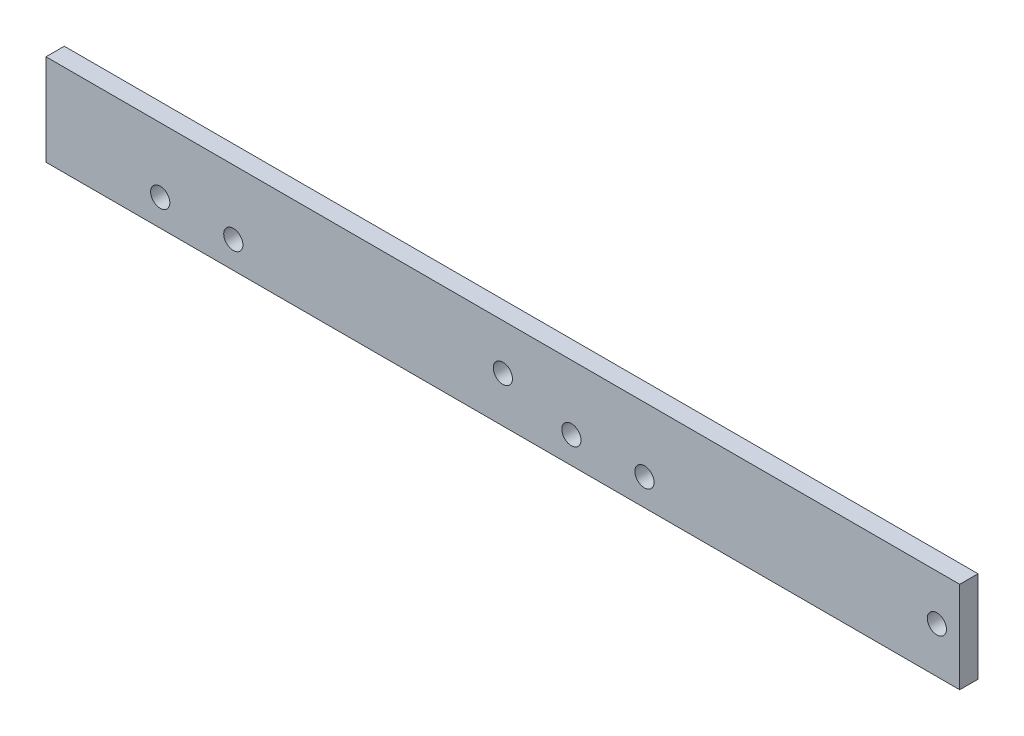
ISO-10303-21;
HEADER;
FILE_DESCRIPTION(('STEP AP214'),'2;1');
FILE_NAME('part.step','',(''),(''),'','','');
FILE_SCHEMA(('AUTOMOTIVE_DESIGN { 1 0 10303 214 1 1 1 1 }'));
ENDSEC;
DATA;
#1=APPLICATION_CONTEXT('core data for automotive mechanical design processes');
#2=APPLICATION_PROTOCOL_DEFINITION('international standard','automotive_design',2000,#1);
#3=PRODUCT_CONTEXT('',#1,'mechanical');
#4=PRODUCT('Part','Part','',(#3));
#5=PRODUCT_RELATED_PRODUCT_CATEGORY('part','',(#4));
#6=PRODUCT_DEFINITION_FORMATION('','',#4);
#7=PRODUCT_DEFINITION_CONTEXT('part definition',#1,'design');
#8=PRODUCT_DEFINITION('design','',#6,#7);
#9=PRODUCT_DEFINITION_SHAPE('','',#8);
#10=(LENGTH_UNIT() NAMED_UNIT(*) SI_UNIT(.MILLI.,.METRE.));
#11=(NAMED_UNIT(*) PLANE_ANGLE_UNIT() SI_UNIT($,.RADIAN.));
#12=(NAMED_UNIT(*) SI_UNIT($,.STERADIAN.) SOLID_ANGLE_UNIT());
#13=UNCERTAINTY_MEASURE_WITH_UNIT(LENGTH_MEASURE(1.E-05),#10,'distance_accuracy_value','');
#14=(GEOMETRIC_REPRESENTATION_CONTEXT(3) GLOBAL_UNCERTAINTY_ASSIGNED_CONTEXT((#13)) GLOBAL_UNIT_ASSIGNED_CONTEXT((#10,
#11,#12)) REPRESENTATION_CONTEXT('',''));
#15=CARTESIAN_POINT('',(0.,0.,0.));
#16=DIRECTION('',(0.,0.,1.));
#17=DIRECTION('',(1.,0.,0.));
#18=AXIS2_PLACEMENT_3D('',#15,#16,#17);
#19=CARTESIAN_POINT('',(0.,0.,4.));
#20=DIRECTION('',(0.,0.,-1.));
#21=DIRECTION('',(-1.,0.,0.));
#22=AXIS2_PLACEMENT_3D('',#19,#20,#21);
#23=PLANE('',#22);
#24=CARTESIAN_POINT('',(15.0000000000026,-4.12920021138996,4.));
#25=DIRECTION('',(0.,0.,1.));
#26=DIRECTION('',(1.,0.,0.));
#27=AXIS2_PLACEMENT_3D('',#24,#25,#26);
#28=CIRCLE('',#27,2.1);
#29=CARTESIAN_POINT('',(17.1000000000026,-4.12920021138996,4.));
#30=VERTEX_POINT('',#29);
#31=EDGE_CURVE('E144',#30,#30,#28,.T.);
#32=ORIENTED_EDGE('',*,*,#31,.F.);
#33=EDGE_LOOP('',(#32));
#34=FACE_BOUND('',#33,.T.);
#35=CARTESIAN_POINT('',(-58.9999999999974,-4.12920021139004,4.));
#36=DIRECTION('',(0.,0.,1.));
#37=DIRECTION('',(1.,0.,0.));
#38=AXIS2_PLACEMENT_3D('',#35,#36,#37);
#39=CIRCLE('',#38,2.1);
#40=CARTESIAN_POINT('',(-56.8999999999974,-4.12920021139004,4.));
#41=VERTEX_POINT('',#40);
#42=EDGE_CURVE('E138',#41,#41,#39,.T.);
#43=ORIENTED_EDGE('',*,*,#42,.F.);
#44=EDGE_LOOP('',(#43));
#45=FACE_BOUND('',#44,.T.);
#46=CARTESIAN_POINT('',(-74.9999999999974,-4.12920021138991,4.));
#47=DIRECTION('',(0.,0.,1.));
#48=DIRECTION('',(1.,0.,0.));
#49=AXIS2_PLACEMENT_3D('',#46,#47,#48);
#50=CIRCLE('',#49,2.1);
#51=CARTESIAN_POINT('',(-72.8999999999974,-4.12920021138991,4.));
#52=VERTEX_POINT('',#51);
#53=EDGE_CURVE('E132',#52,#52,#50,.T.);
#54=ORIENTED_EDGE('',*,*,#53,.F.);
#55=EDGE_LOOP('',(#54));
#56=FACE_BOUND('',#55,.T.);
#57=CARTESIAN_POINT('',(31.0000000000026,-4.1292002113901,4.));
#58=DIRECTION('',(0.,0.,1.));
#59=DIRECTION('',(1.,0.,0.));
#60=AXIS2_PLACEMENT_3D('',#57,#58,#59);
#61=CIRCLE('',#60,2.1);
#62=CARTESIAN_POINT('',(33.1000000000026,-4.1292002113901,4.));
#63=VERTEX_POINT('',#62);
#64=EDGE_CURVE('E126',#63,#63,#61,.T.);
#65=ORIENTED_EDGE('',*,*,#64,.F.);
#66=EDGE_LOOP('',(#65));
#67=FACE_BOUND('',#66,.T.);
#68=DIRECTION('',(0.,1.,0.));
#69=VECTOR('',#68,1.);
#70=CARTESIAN_POINT('',(100.,-10.,4.));
#71=LINE('',#70,#69);
#72=CARTESIAN_POINT('',(100.,-10.,4.));
#73=VERTEX_POINT('',#72);
#74=CARTESIAN_POINT('',(100.,10.,4.));
#75=VERTEX_POINT('',#74);
#76=EDGE_CURVE('E87',#73,#75,#71,.T.);
#77=ORIENTED_EDGE('',*,*,#76,.T.);
#78=DIRECTION('',(-1.,0.,0.));
#79=VECTOR('',#78,1.);
#80=CARTESIAN_POINT('',(-100.,10.,4.));
#81=LINE('',#80,#79);
#82=CARTESIAN_POINT('',(-100.,10.,4.));
#83=VERTEX_POINT('',#82);
#84=EDGE_CURVE('E82',#75,#83,#81,.T.);
#85=ORIENTED_EDGE('',*,*,#84,.T.);
#86=DIRECTION('',(0.,-1.,0.));
#87=VECTOR('',#86,1.);
#88=CARTESIAN_POINT('',(-100.,-10.,4.));
#89=LINE('',#88,#87);
#90=CARTESIAN_POINT('',(-100.,-10.,4.));
#91=VERTEX_POINT('',#90);
#92=EDGE_CURVE('E85',#83,#91,#89,.T.);
#93=ORIENTED_EDGE('',*,*,#92,.T.);
#94=DIRECTION('',(1.,0.,0.));
#95=VECTOR('',#94,1.);
#96=CARTESIAN_POINT('',(-100.,-10.,4.));
#97=LINE('',#96,#95);
#98=EDGE_CURVE('E52',#91,#73,#97,.T.);
#99=ORIENTED_EDGE('',*,*,#98,.T.);
#100=EDGE_LOOP('',(#77,#85,#93,#99));
#101=FACE_BOUND('',#100,.T.);
#102=CARTESIAN_POINT('',(95.,0.,4.));
#103=DIRECTION('',(0.,0.,1.));
#104=DIRECTION('',(1.,0.,0.));
#105=AXIS2_PLACEMENT_3D('',#102,#103,#104);
#106=CIRCLE('',#105,2.1);
#107=CARTESIAN_POINT('',(97.1,0.,4.));
#108=VERTEX_POINT('',#107);
#109=EDGE_CURVE('E102',#108,#108,#106,.T.);
#110=ORIENTED_EDGE('',*,*,#109,.F.);
#111=EDGE_LOOP('',(#110));
#112=FACE_BOUND('',#111,.T.);
#113=CARTESIAN_POINT('',(0.,0.,4.));
#114=DIRECTION('',(0.,0.,1.));
#115=DIRECTION('',(1.,0.,0.));
#116=AXIS2_PLACEMENT_3D('',#113,#114,#115);
#117=CIRCLE('',#116,2.1);
#118=CARTESIAN_POINT('',(2.10000000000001,0.,4.));
#119=VERTEX_POINT('',#118);
#120=EDGE_CURVE('E117',#119,#119,#117,.T.);
#121=ORIENTED_EDGE('',*,*,#120,.F.);
#122=EDGE_LOOP('',(#121));
#123=FACE_BOUND('',#122,.T.);
#124=ADVANCED_FACE('F35',(#34,#45,#56,#67,#101,#112,#123),#23,.F.);
#125=CARTESIAN_POINT('',(0.,0.,0.));
#126=DIRECTION('',(0.,0.,-1.));
#127=DIRECTION('',(-1.,0.,0.));
#128=AXIS2_PLACEMENT_3D('',#125,#126,#127);
#129=PLANE('',#128);
#130=CARTESIAN_POINT('',(15.0000000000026,-4.12920021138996,0.));
#131=DIRECTION('',(0.,0.,1.));
#132=DIRECTION('',(1.,0.,0.));
#133=AXIS2_PLACEMENT_3D('',#130,#131,#132);
#134=CIRCLE('',#133,2.1);
#135=CARTESIAN_POINT('',(17.1000000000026,-4.12920021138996,0.));
#136=VERTEX_POINT('',#135);
#137=EDGE_CURVE('E129',#136,#136,#134,.T.);
#138=ORIENTED_EDGE('',*,*,#137,.T.);
#139=EDGE_LOOP('',(#138));
#140=FACE_BOUND('',#139,.T.);
#141=CARTESIAN_POINT('',(-58.9999999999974,-4.12920021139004,0.));
#142=DIRECTION('',(0.,0.,1.));
#143=DIRECTION('',(1.,0.,0.));
#144=AXIS2_PLACEMENT_3D('',#141,#142,#143);
#145=CIRCLE('',#144,2.1);
#146=CARTESIAN_POINT('',(-56.8999999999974,-4.12920021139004,0.));
#147=VERTEX_POINT('',#146);
#148=EDGE_CURVE('E141',#147,#147,#145,.T.);
#149=ORIENTED_EDGE('',*,*,#148,.T.);
#150=EDGE_LOOP('',(#149));
#151=FACE_BOUND('',#150,.T.);
#152=CARTESIAN_POINT('',(-74.9999999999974,-4.12920021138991,0.));
#153=DIRECTION('',(0.,0.,1.));
#154=DIRECTION('',(1.,0.,0.));
#155=AXIS2_PLACEMENT_3D('',#152,#153,#154);
#156=CIRCLE('',#155,2.1);
#157=CARTESIAN_POINT('',(-72.8999999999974,-4.12920021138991,0.));
#158=VERTEX_POINT('',#157);
#159=EDGE_CURVE('E135',#158,#158,#156,.T.);
#160=ORIENTED_EDGE('',*,*,#159,.T.);
#161=EDGE_LOOP('',(#160));
#162=FACE_BOUND('',#161,.T.);
#163=CARTESIAN_POINT('',(31.0000000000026,-4.1292002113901,0.));
#164=DIRECTION('',(0.,0.,1.));
#165=DIRECTION('',(1.,0.,0.));
#166=AXIS2_PLACEMENT_3D('',#163,#164,#165);
#167=CIRCLE('',#166,2.1);
#168=CARTESIAN_POINT('',(33.1000000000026,-4.1292002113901,0.));
#169=VERTEX_POINT('',#168);
#170=EDGE_CURVE('E123',#169,#169,#167,.T.);
#171=ORIENTED_EDGE('',*,*,#170,.T.);
#172=EDGE_LOOP('',(#171));
#173=FACE_BOUND('',#172,.T.);
#174=CARTESIAN_POINT('',(95.,0.,0.));
#175=DIRECTION('',(0.,0.,1.));
#176=DIRECTION('',(1.,0.,0.));
#177=AXIS2_PLACEMENT_3D('',#174,#175,#176);
#178=CIRCLE('',#177,2.1);
#179=CARTESIAN_POINT('',(97.1,0.,0.));
#180=VERTEX_POINT('',#179);
#181=EDGE_CURVE('E114',#180,#180,#178,.T.);
#182=ORIENTED_EDGE('',*,*,#181,.T.);
#183=EDGE_LOOP('',(#182));
#184=FACE_BOUND('',#183,.T.);
#185=DIRECTION('',(0.,1.,0.));
#186=VECTOR('',#185,1.);
#187=CARTESIAN_POINT('',(100.,-10.,0.));
#188=LINE('',#187,#186);
#189=CARTESIAN_POINT('',(100.,-10.,0.));
#190=VERTEX_POINT('',#189);
#191=CARTESIAN_POINT('',(100.,10.,0.));
#192=VERTEX_POINT('',#191);
#193=EDGE_CURVE('E99',#190,#192,#188,.T.);
#194=ORIENTED_EDGE('',*,*,#193,.F.);
#195=DIRECTION('',(1.,0.,0.));
#196=VECTOR('',#195,1.);
#197=CARTESIAN_POINT('',(-100.,-10.,0.));
#198=LINE('',#197,#196);
#199=CARTESIAN_POINT('',(-100.,-10.,0.));
#200=VERTEX_POINT('',#199);
#201=EDGE_CURVE('E75',#200,#190,#198,.T.);
#202=ORIENTED_EDGE('',*,*,#201,.F.);
#203=DIRECTION('',(0.,-1.,0.));
#204=VECTOR('',#203,1.);
#205=CARTESIAN_POINT('',(-100.,-10.,0.));
#206=LINE('',#205,#204);
#207=CARTESIAN_POINT('',(-100.,10.,0.));
#208=VERTEX_POINT('',#207);
#209=EDGE_CURVE('E69',#208,#200,#206,.T.);
#210=ORIENTED_EDGE('',*,*,#209,.F.);
#211=DIRECTION('',(-1.,0.,0.));
#212=VECTOR('',#211,1.);
#213=CARTESIAN_POINT('',(-100.,10.,0.));
#214=LINE('',#213,#212);
#215=EDGE_CURVE('E91',#192,#208,#214,.T.);
#216=ORIENTED_EDGE('',*,*,#215,.F.);
#217=EDGE_LOOP('',(#194,#202,#210,#216));
#218=FACE_BOUND('',#217,.T.);
#219=CARTESIAN_POINT('',(0.,0.,0.));
#220=DIRECTION('',(0.,0.,1.));
#221=DIRECTION('',(1.,0.,0.));
#222=AXIS2_PLACEMENT_3D('',#219,#220,#221);
#223=CIRCLE('',#222,2.1);
#224=CARTESIAN_POINT('',(2.10000000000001,0.,0.));
#225=VERTEX_POINT('',#224);
#226=EDGE_CURVE('E120',#225,#225,#223,.T.);
#227=ORIENTED_EDGE('',*,*,#226,.T.);
#228=EDGE_LOOP('',(#227));
#229=FACE_BOUND('',#228,.T.);
#230=ADVANCED_FACE('F110',(#140,#151,#162,#173,#184,#218,#229),#129,.T.);
#231=CARTESIAN_POINT('',(100.,-10.,4.));
#232=DIRECTION('',(-1.,0.,0.));
#233=DIRECTION('',(0.,0.,1.));
#234=AXIS2_PLACEMENT_3D('',#231,#232,#233);
#235=PLANE('',#234);
#236=ORIENTED_EDGE('',*,*,#193,.T.);
#237=DIRECTION('',(0.,0.,-1.));
#238=VECTOR('',#237,1.);
#239=CARTESIAN_POINT('',(100.,10.,4.));
#240=LINE('',#239,#238);
#241=EDGE_CURVE('E11',#75,#192,#240,.T.);
#242=ORIENTED_EDGE('',*,*,#241,.F.);
#243=ORIENTED_EDGE('',*,*,#76,.F.);
#244=DIRECTION('',(0.,0.,-1.));
#245=VECTOR('',#244,1.);
#246=CARTESIAN_POINT('',(100.,-10.,4.));
#247=LINE('',#246,#245);
#248=EDGE_CURVE('E95',#73,#190,#247,.T.);
#249=ORIENTED_EDGE('',*,*,#248,.T.);
#250=EDGE_LOOP('',(#236,#242,#243,#249));
#251=FACE_BOUND('',#250,.T.);
#252=ADVANCED_FACE('F37',(#251),#235,.F.);
#253=CARTESIAN_POINT('',(-100.,10.,4.));
#254=DIRECTION('',(0.,-1.,0.));
#255=DIRECTION('',(0.,0.,-1.));
#256=AXIS2_PLACEMENT_3D('',#253,#254,#255);
#257=PLANE('',#256);
#258=ORIENTED_EDGE('',*,*,#215,.T.);
#259=DIRECTION('',(0.,0.,-1.));
#260=VECTOR('',#259,1.);
#261=CARTESIAN_POINT('',(-100.,10.,4.));
#262=LINE('',#261,#260);
#263=EDGE_CURVE('E44',#83,#208,#262,.T.);
#264=ORIENTED_EDGE('',*,*,#263,.F.);
#265=ORIENTED_EDGE('',*,*,#84,.F.);
#266=ORIENTED_EDGE('',*,*,#241,.T.);
#267=EDGE_LOOP('',(#258,#264,#265,#266));
#268=FACE_BOUND('',#267,.T.);
#269=ADVANCED_FACE('F90',(#268),#257,.F.);
#270=CARTESIAN_POINT('',(-100.,-10.,4.));
#271=DIRECTION('',(1.,0.,0.));
#272=DIRECTION('',(0.,0.,-1.));
#273=AXIS2_PLACEMENT_3D('',#270,#271,#272);
#274=PLANE('',#273);
#275=ORIENTED_EDGE('',*,*,#209,.T.);
#276=DIRECTION('',(0.,0.,-1.));
#277=VECTOR('',#276,1.);
#278=CARTESIAN_POINT('',(-100.,-10.,4.));
#279=LINE('',#278,#277);
#280=EDGE_CURVE('E92',#91,#200,#279,.T.);
#281=ORIENTED_EDGE('',*,*,#280,.F.);
#282=ORIENTED_EDGE('',*,*,#92,.F.);
#283=ORIENTED_EDGE('',*,*,#263,.T.);
#284=EDGE_LOOP('',(#275,#281,#282,#283));
#285=FACE_BOUND('',#284,.T.);
#286=ADVANCED_FACE('F93',(#285),#274,.F.);
#287=CARTESIAN_POINT('',(-100.,-10.,4.));
#288=DIRECTION('',(0.,1.,0.));
#289=DIRECTION('',(0.,0.,1.));
#290=AXIS2_PLACEMENT_3D('',#287,#288,#289);
#291=PLANE('',#290);
#292=ORIENTED_EDGE('',*,*,#201,.T.);
#293=ORIENTED_EDGE('',*,*,#248,.F.);
#294=ORIENTED_EDGE('',*,*,#98,.F.);
#295=ORIENTED_EDGE('',*,*,#280,.T.);
#296=EDGE_LOOP('',(#292,#293,#294,#295));
#297=FACE_BOUND('',#296,.T.);
#298=ADVANCED_FACE('F107',(#297),#291,.F.);
#299=CARTESIAN_POINT('',(95.,0.,4.));
#300=DIRECTION('',(0.,0.,-1.));
#301=DIRECTION('',(-1.,0.,0.));
#302=AXIS2_PLACEMENT_3D('',#299,#300,#301);
#303=CYLINDRICAL_SURFACE('',#302,2.1);
#304=ORIENTED_EDGE('',*,*,#109,.T.);
#305=EDGE_LOOP('',(#304));
#306=FACE_BOUND('',#305,.T.);
#307=ORIENTED_EDGE('',*,*,#181,.F.);
#308=EDGE_LOOP('',(#307));
#309=FACE_BOUND('',#308,.T.);
#310=ADVANCED_FACE('F180',(#306,#309),#303,.F.);
#311=CARTESIAN_POINT('',(0.,0.,4.));
#312=DIRECTION('',(0.,0.,-1.));
#313=DIRECTION('',(-1.,0.,0.));
#314=AXIS2_PLACEMENT_3D('',#311,#312,#313);
#315=CYLINDRICAL_SURFACE('',#314,2.1);
#316=ORIENTED_EDGE('',*,*,#120,.T.);
#317=EDGE_LOOP('',(#316));
#318=FACE_BOUND('',#317,.T.);
#319=ORIENTED_EDGE('',*,*,#226,.F.);
#320=EDGE_LOOP('',(#319));
#321=FACE_BOUND('',#320,.T.);
#322=ADVANCED_FACE('F171',(#318,#321),#315,.F.);
#323=CARTESIAN_POINT('',(31.0000000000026,-4.1292002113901,0.));
#324=DIRECTION('',(0.,0.,1.));
#325=DIRECTION('',(1.,0.,0.));
#326=AXIS2_PLACEMENT_3D('',#323,#324,#325);
#327=CYLINDRICAL_SURFACE('',#326,2.1);
#328=ORIENTED_EDGE('',*,*,#170,.F.);
#329=EDGE_LOOP('',(#328));
#330=FACE_BOUND('',#329,.T.);
#331=ORIENTED_EDGE('',*,*,#64,.T.);
#332=EDGE_LOOP('',(#331));
#333=FACE_BOUND('',#332,.T.);
#334=ADVANCED_FACE('F168',(#330,#333),#327,.F.);
#335=CARTESIAN_POINT('',(-74.9999999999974,-4.12920021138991,0.));
#336=DIRECTION('',(0.,0.,1.));
#337=DIRECTION('',(1.,0.,0.));
#338=AXIS2_PLACEMENT_3D('',#335,#336,#337);
#339=CYLINDRICAL_SURFACE('',#338,2.1);
#340=ORIENTED_EDGE('',*,*,#159,.F.);
#341=EDGE_LOOP('',(#340));
#342=FACE_BOUND('',#341,.T.);
#343=ORIENTED_EDGE('',*,*,#53,.T.);
#344=EDGE_LOOP('',(#343));
#345=FACE_BOUND('',#344,.T.);
#346=ADVANCED_FACE('F170',(#342,#345),#339,.F.);
#347=CARTESIAN_POINT('',(-58.9999999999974,-4.12920021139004,0.));
#348=DIRECTION('',(0.,0.,1.));
#349=DIRECTION('',(1.,0.,0.));
#350=AXIS2_PLACEMENT_3D('',#347,#348,#349);
#351=CYLINDRICAL_SURFACE('',#350,2.1);
#352=ORIENTED_EDGE('',*,*,#148,.F.);
#353=EDGE_LOOP('',(#352));
#354=FACE_BOUND('',#353,.T.);
#355=ORIENTED_EDGE('',*,*,#42,.T.);
#356=EDGE_LOOP('',(#355));
#357=FACE_BOUND('',#356,.T.);
#358=ADVANCED_FACE('F155',(#354,#357),#351,.F.);
#359=CARTESIAN_POINT('',(15.0000000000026,-4.12920021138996,0.));
#360=DIRECTION('',(0.,0.,1.));
#361=DIRECTION('',(1.,0.,0.));
#362=AXIS2_PLACEMENT_3D('',#359,#360,#361);
#363=CYLINDRICAL_SURFACE('',#362,2.1);
#364=ORIENTED_EDGE('',*,*,#137,.F.);
#365=EDGE_LOOP('',(#364));
#366=FACE_BOUND('',#365,.T.);
#367=ORIENTED_EDGE('',*,*,#31,.T.);
#368=EDGE_LOOP('',(#367));
#369=FACE_BOUND('',#368,.T.);
#370=ADVANCED_FACE('F152',(#366,#369),#363,.F.);
#371=CLOSED_SHELL('',(#124,#230,#252,#269,#286,#298,#310,#322,#334,#346,#358,#370));
#372=MANIFOLD_SOLID_BREP('B2',#371);
#373=ADVANCED_BREP_SHAPE_REPRESENTATION('',(#18,#372),#14);
#374=SHAPE_DEFINITION_REPRESENTATION(#9,#373);
ENDSEC;
END-ISO-10303-21;
